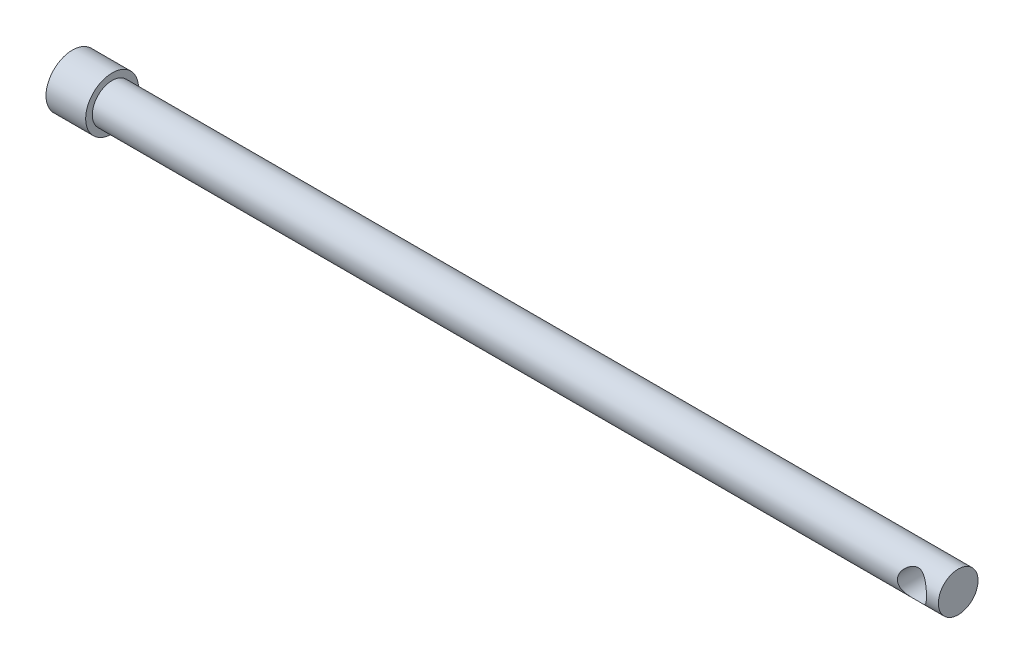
ISO-10303-21;
HEADER;
FILE_DESCRIPTION(('STEP AP214'),'2;1');
FILE_NAME('part.step','',(''),(''),'','','');
FILE_SCHEMA(('AUTOMOTIVE_DESIGN { 1 0 10303 214 1 1 1 1 }'));
ENDSEC;
DATA;
#1=APPLICATION_CONTEXT('core data for automotive mechanical design processes');
#2=APPLICATION_PROTOCOL_DEFINITION('international standard','automotive_design',2000,#1);
#3=PRODUCT_CONTEXT('',#1,'mechanical');
#4=PRODUCT('Part','Part','',(#3));
#5=PRODUCT_RELATED_PRODUCT_CATEGORY('part','',(#4));
#6=PRODUCT_DEFINITION_FORMATION('','',#4);
#7=PRODUCT_DEFINITION_CONTEXT('part definition',#1,'design');
#8=PRODUCT_DEFINITION('design','',#6,#7);
#9=PRODUCT_DEFINITION_SHAPE('','',#8);
#10=(LENGTH_UNIT() NAMED_UNIT(*) SI_UNIT(.MILLI.,.METRE.));
#11=(NAMED_UNIT(*) PLANE_ANGLE_UNIT() SI_UNIT($,.RADIAN.));
#12=(NAMED_UNIT(*) SI_UNIT($,.STERADIAN.) SOLID_ANGLE_UNIT());
#13=UNCERTAINTY_MEASURE_WITH_UNIT(LENGTH_MEASURE(1.E-05),#10,'distance_accuracy_value','');
#14=(GEOMETRIC_REPRESENTATION_CONTEXT(3) GLOBAL_UNCERTAINTY_ASSIGNED_CONTEXT((#13)) GLOBAL_UNIT_ASSIGNED_CONTEXT((#10,
#11,#12)) REPRESENTATION_CONTEXT('',''));
#15=CARTESIAN_POINT('',(0.,0.,0.));
#16=DIRECTION('',(0.,0.,1.));
#17=DIRECTION('',(1.,0.,0.));
#18=AXIS2_PLACEMENT_3D('',#15,#16,#17);
#19=CARTESIAN_POINT('',(-650.,0.,0.));
#20=DIRECTION('',(1.,0.,0.));
#21=DIRECTION('',(0.,0.,-1.));
#22=AXIS2_PLACEMENT_3D('',#19,#20,#21);
#23=PLANE('',#22);
#24=CARTESIAN_POINT('',(-650.,0.,0.));
#25=DIRECTION('',(-1.,0.,0.));
#26=DIRECTION('',(0.,0.,1.));
#27=AXIS2_PLACEMENT_3D('',#24,#25,#26);
#28=CIRCLE('',#27,20.);
#29=CARTESIAN_POINT('',(-650.,0.,20.));
#30=VERTEX_POINT('',#29);
#31=EDGE_CURVE('E18',#30,#30,#28,.F.);
#32=ORIENTED_EDGE('',*,*,#31,.F.);
#33=EDGE_LOOP('',(#32));
#34=FACE_BOUND('',#33,.T.);
#35=ADVANCED_FACE('F13',(#34),#23,.F.);
#36=CARTESIAN_POINT('',(-620.,0.,0.));
#37=DIRECTION('',(-1.,0.,0.));
#38=DIRECTION('',(0.,0.,1.));
#39=AXIS2_PLACEMENT_3D('',#36,#37,#38);
#40=CYLINDRICAL_SURFACE('',#39,20.);
#41=ORIENTED_EDGE('',*,*,#31,.T.);
#42=EDGE_LOOP('',(#41));
#43=FACE_BOUND('',#42,.T.);
#44=CARTESIAN_POINT('',(-620.,0.,0.));
#45=DIRECTION('',(-1.,0.,0.));
#46=DIRECTION('',(0.,0.,1.));
#47=AXIS2_PLACEMENT_3D('',#44,#45,#46);
#48=CIRCLE('',#47,20.);
#49=CARTESIAN_POINT('',(-620.,0.,20.));
#50=VERTEX_POINT('',#49);
#51=EDGE_CURVE('E46',#50,#50,#48,.T.);
#52=ORIENTED_EDGE('',*,*,#51,.T.);
#53=EDGE_LOOP('',(#52));
#54=FACE_BOUND('',#53,.T.);
#55=ADVANCED_FACE('F53',(#43,#54),#40,.T.);
#56=CARTESIAN_POINT('',(20.,0.,0.));
#57=DIRECTION('',(1.,0.,0.));
#58=DIRECTION('',(0.,0.,-1.));
#59=AXIS2_PLACEMENT_3D('',#56,#57,#58);
#60=PLANE('',#59);
#61=CARTESIAN_POINT('',(20.,0.,0.));
#62=DIRECTION('',(-1.,0.,0.));
#63=DIRECTION('',(0.,0.,1.));
#64=AXIS2_PLACEMENT_3D('',#61,#62,#63);
#65=CIRCLE('',#64,15.);
#66=CARTESIAN_POINT('',(20.,0.,15.));
#67=VERTEX_POINT('',#66);
#68=EDGE_CURVE('E44',#67,#67,#65,.T.);
#69=ORIENTED_EDGE('',*,*,#68,.F.);
#70=EDGE_LOOP('',(#69));
#71=FACE_BOUND('',#70,.T.);
#72=ADVANCED_FACE('F61',(#71),#60,.T.);
#73=CARTESIAN_POINT('',(-620.,0.,0.));
#74=DIRECTION('',(-1.,0.,0.));
#75=DIRECTION('',(0.,0.,1.));
#76=AXIS2_PLACEMENT_3D('',#73,#74,#75);
#77=PLANE('',#76);
#78=CARTESIAN_POINT('',(-620.,0.,0.));
#79=DIRECTION('',(-1.,0.,0.));
#80=DIRECTION('',(0.,0.,1.));
#81=AXIS2_PLACEMENT_3D('',#78,#79,#80);
#82=CIRCLE('',#81,15.);
#83=CARTESIAN_POINT('',(-620.,0.,15.));
#84=VERTEX_POINT('',#83);
#85=EDGE_CURVE('E22',#84,#84,#82,.F.);
#86=ORIENTED_EDGE('',*,*,#85,.F.);
#87=EDGE_LOOP('',(#86));
#88=FACE_BOUND('',#87,.T.);
#89=ORIENTED_EDGE('',*,*,#51,.F.);
#90=EDGE_LOOP('',(#89));
#91=FACE_BOUND('',#90,.T.);
#92=ADVANCED_FACE('F36',(#88,#91),#77,.F.);
#93=CARTESIAN_POINT('',(0.,0.,-15.));
#94=DIRECTION('',(0.,0.,1.));
#95=DIRECTION('',(1.,0.,0.));
#96=AXIS2_PLACEMENT_3D('',#93,#94,#95);
#97=CYLINDRICAL_SURFACE('',#96,11.);
#98=CARTESIAN_POINT('',(11.,0.,-15.));
#99=CARTESIAN_POINT('',(10.9999989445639,0.270234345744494,-14.9999989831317));
#100=CARTESIAN_POINT('',(10.9900265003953,0.540485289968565,-14.9926814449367));
#101=CARTESIAN_POINT('',(10.950295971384,1.07885095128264,-14.963582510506));
#102=CARTESIAN_POINT('',(10.9205289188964,1.34696464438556,-14.9417945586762));
#103=CARTESIAN_POINT('',(10.8416275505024,1.87926318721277,-14.8842251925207));
#104=CARTESIAN_POINT('',(10.792460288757,2.14344055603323,-14.8484199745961));
#105=CARTESIAN_POINT('',(10.6755308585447,2.66544248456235,-14.7636492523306));
#106=CARTESIAN_POINT('',(10.60777051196,2.92326766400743,-14.7146850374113));
#107=CARTESIAN_POINT('',(10.455056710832,3.42947281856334,-14.6049788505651));
#108=CARTESIAN_POINT('',(10.3702054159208,3.67789896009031,-14.5443069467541));
#109=CARTESIAN_POINT('',(10.1841148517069,4.16556445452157,-14.4122135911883));
#110=CARTESIAN_POINT('',(10.0828752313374,4.40480361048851,-14.3407919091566));
#111=CARTESIAN_POINT('',(9.86513916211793,4.87295052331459,-14.1885487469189));
#112=CARTESIAN_POINT('',(9.7486501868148,5.10186326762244,-14.1077318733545));
#113=CARTESIAN_POINT('',(9.50137535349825,5.5487947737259,-13.9380072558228));
#114=CARTESIAN_POINT('',(9.37058417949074,5.76680944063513,-13.8490965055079));
#115=CARTESIAN_POINT('',(9.08316785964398,6.21065135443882,-13.6561916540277));
#116=CARTESIAN_POINT('',(8.92527466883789,6.4353804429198,-13.5515613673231));
#117=CARTESIAN_POINT('',(8.59474679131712,6.8705899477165,-13.3361895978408));
#118=CARTESIAN_POINT('',(8.42211168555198,7.08106995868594,-13.2254479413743));
#119=CARTESIAN_POINT('',(8.06272673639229,7.48773584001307,-12.9995381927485));
#120=CARTESIAN_POINT('',(7.87595550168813,7.68389912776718,-12.8843635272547));
#121=CARTESIAN_POINT('',(7.48928883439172,8.06123556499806,-12.6517037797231));
#122=CARTESIAN_POINT('',(7.28939585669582,8.242411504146,-12.5342191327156));
#123=CARTESIAN_POINT('',(6.83682363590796,8.62331346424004,-12.2760403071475));
#124=CARTESIAN_POINT('',(6.58144005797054,8.81979231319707,-12.1352768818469));
#125=CARTESIAN_POINT('',(6.05311944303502,9.19042440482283,-11.8570571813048));
#126=CARTESIAN_POINT('',(5.7801773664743,9.36457119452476,-11.7196018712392));
#127=CARTESIAN_POINT('',(5.21744212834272,9.68936187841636,-11.4525286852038));
#128=CARTESIAN_POINT('',(4.92766801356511,9.84003165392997,-11.3229022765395));
#129=CARTESIAN_POINT('',(4.33141573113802,10.1166556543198,-11.076442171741));
#130=CARTESIAN_POINT('',(4.02494703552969,10.242623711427,-10.9596013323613));
#131=CARTESIAN_POINT('',(3.50094853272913,10.4303850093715,-10.7804394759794));
#132=CARTESIAN_POINT('',(3.28782250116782,10.4995737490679,-10.7129270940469));
#133=CARTESIAN_POINT('',(2.85500800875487,10.625426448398,-10.5881143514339));
#134=CARTESIAN_POINT('',(2.6353216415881,10.6820943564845,-10.5308107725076));
#135=CARTESIAN_POINT('',(2.19056026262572,10.7820819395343,-10.4284147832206));
#136=CARTESIAN_POINT('',(1.9654960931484,10.8254263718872,-10.3832997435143));
#137=CARTESIAN_POINT('',(1.51077883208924,10.8981901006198,-10.3069029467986));
#138=CARTESIAN_POINT('',(1.28112576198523,10.9276094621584,-10.2756211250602));
#139=CARTESIAN_POINT('',(0.817016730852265,10.9721120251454,-10.2280907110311));
#140=CARTESIAN_POINT('',(0.582537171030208,10.9870802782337,-10.2119626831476));
#141=CARTESIAN_POINT('',(0.112548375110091,11.0019364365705,-10.1959559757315));
#142=CARTESIAN_POINT('',(-0.122960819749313,11.0018249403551,-10.1960766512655));
#143=CARTESIAN_POINT('',(-0.593049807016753,10.9865203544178,-10.2125654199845));
#144=CARTESIAN_POINT('',(-0.827628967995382,10.9713183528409,-10.2289431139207));
#145=CARTESIAN_POINT('',(-1.29374843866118,10.9261645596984,-10.2771594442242));
#146=CARTESIAN_POINT('',(-1.52528840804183,10.8962111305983,-10.3089997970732));
#147=CARTESIAN_POINT('',(-2.00856310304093,10.8181280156,-10.3909399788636));
#148=CARTESIAN_POINT('',(-2.25976351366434,10.7683789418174,-10.4426460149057));
#149=CARTESIAN_POINT('',(-2.75472374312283,10.6525201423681,-10.5608080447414));
#150=CARTESIAN_POINT('',(-2.99848250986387,10.5864081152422,-10.6272661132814));
#151=CARTESIAN_POINT('',(-3.71799960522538,10.3647718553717,-10.8450088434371));
#152=CARTESIAN_POINT('',(-4.18133061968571,10.1860595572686,-11.0145361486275));
#153=CARTESIAN_POINT('',(-4.92554456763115,9.84116811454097,-11.3219366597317));
#154=CARTESIAN_POINT('',(-5.2168211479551,9.68975954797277,-11.4522158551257));
#155=CARTESIAN_POINT('',(-5.78225957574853,9.36333004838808,-11.7206082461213));
#156=CARTESIAN_POINT('',(-6.05641582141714,9.18830144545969,-11.8587239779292));
#157=CARTESIAN_POINT('',(-6.58728128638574,8.81550158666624,-12.1384232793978));
#158=CARTESIAN_POINT('',(-6.8439744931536,8.61770989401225,-12.2800098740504));
#159=CARTESIAN_POINT('',(-7.33908375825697,8.20016329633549,-12.562678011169));
#160=CARTESIAN_POINT('',(-7.57750193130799,7.9804109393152,-12.7037596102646));
#161=CARTESIAN_POINT('',(-8.03836541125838,7.51619216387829,-12.9838893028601));
#162=CARTESIAN_POINT('',(-8.26054003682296,7.27142254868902,-13.1228811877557));
#163=CARTESIAN_POINT('',(-8.68379183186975,6.76031353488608,-13.3933474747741));
#164=CARTESIAN_POINT('',(-8.88486659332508,6.4939716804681,-13.5248210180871));
#165=CARTESIAN_POINT('',(-9.26374282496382,5.9409781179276,-13.7766812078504));
#166=CARTESIAN_POINT('',(-9.44158119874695,5.65435975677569,-13.8970853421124));
#167=CARTESIAN_POINT('',(-9.7721047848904,5.06171559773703,-14.1237235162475));
#168=CARTESIAN_POINT('',(-9.92480016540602,4.75569771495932,-14.2299632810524));
#169=CARTESIAN_POINT('',(-10.1671126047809,4.20659794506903,-14.4001660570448));
#170=CARTESIAN_POINT('',(-10.2628788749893,3.96740850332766,-14.4679959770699));
#171=CARTESIAN_POINT('',(-10.4380921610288,3.48039642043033,-14.5928058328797));
#172=CARTESIAN_POINT('',(-10.5175428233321,3.2325757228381,-14.649788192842));
#173=CARTESIAN_POINT('',(-10.659004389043,2.73012906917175,-14.7516769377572));
#174=CARTESIAN_POINT('',(-10.7210502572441,2.47551789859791,-14.7966075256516));
#175=CARTESIAN_POINT('',(-10.8270300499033,1.96072320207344,-14.8735755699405));
#176=CARTESIAN_POINT('',(-10.87097136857,1.70054199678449,-14.9056182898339));
#177=CARTESIAN_POINT('',(-10.9368839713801,1.20084572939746,-14.953761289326));
#178=CARTESIAN_POINT('',(-10.9605217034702,0.961665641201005,-14.9710694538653));
#179=CARTESIAN_POINT('',(-10.9920819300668,0.481661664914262,-14.994190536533));
#180=CARTESIAN_POINT('',(-11.0000009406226,0.240837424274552,-15.0000009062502));
#181=CARTESIAN_POINT('',(-10.9999989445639,-0.270234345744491,-14.9999989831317));
#182=CARTESIAN_POINT('',(-10.9900265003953,-0.540485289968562,-14.9926814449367));
#183=CARTESIAN_POINT('',(-10.950295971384,-1.07885095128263,-14.963582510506));
#184=CARTESIAN_POINT('',(-10.9205289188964,-1.34696464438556,-14.9417945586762));
#185=CARTESIAN_POINT('',(-10.8416275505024,-1.87926318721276,-14.8842251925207));
#186=CARTESIAN_POINT('',(-10.792460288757,-2.14344055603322,-14.8484199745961));
#187=CARTESIAN_POINT('',(-10.6755308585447,-2.66544248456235,-14.7636492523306));
#188=CARTESIAN_POINT('',(-10.60777051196,-2.92326766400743,-14.7146850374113));
#189=CARTESIAN_POINT('',(-10.455056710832,-3.42947281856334,-14.6049788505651));
#190=CARTESIAN_POINT('',(-10.3702054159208,-3.67789896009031,-14.5443069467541));
#191=CARTESIAN_POINT('',(-10.1841148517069,-4.16556445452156,-14.4122135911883));
#192=CARTESIAN_POINT('',(-10.0828752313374,-4.40480361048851,-14.3407919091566));
#193=CARTESIAN_POINT('',(-9.86513916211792,-4.87295052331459,-14.1885487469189));
#194=CARTESIAN_POINT('',(-9.7486501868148,-5.10186326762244,-14.1077318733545));
#195=CARTESIAN_POINT('',(-9.50137535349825,-5.5487947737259,-13.9380072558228));
#196=CARTESIAN_POINT('',(-9.37058417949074,-5.76680944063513,-13.8490965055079));
#197=CARTESIAN_POINT('',(-9.08316785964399,-6.21065135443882,-13.6561916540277));
#198=CARTESIAN_POINT('',(-8.92527466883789,-6.4353804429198,-13.5515613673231));
#199=CARTESIAN_POINT('',(-8.59474679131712,-6.8705899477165,-13.3361895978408));
#200=CARTESIAN_POINT('',(-8.42211168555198,-7.08106995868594,-13.2254479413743));
#201=CARTESIAN_POINT('',(-8.06272673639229,-7.48773584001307,-12.9995381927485));
#202=CARTESIAN_POINT('',(-7.87595550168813,-7.68389912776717,-12.8843635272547));
#203=CARTESIAN_POINT('',(-7.48928883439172,-8.06123556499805,-12.6517037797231));
#204=CARTESIAN_POINT('',(-7.28939585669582,-8.242411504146,-12.5342191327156));
#205=CARTESIAN_POINT('',(-6.83682363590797,-8.62331346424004,-12.2760403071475));
#206=CARTESIAN_POINT('',(-6.58144005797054,-8.81979231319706,-12.1352768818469));
#207=CARTESIAN_POINT('',(-6.05311944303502,-9.19042440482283,-11.8570571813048));
#208=CARTESIAN_POINT('',(-5.78017736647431,-9.36457119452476,-11.7196018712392));
#209=CARTESIAN_POINT('',(-5.21744212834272,-9.68936187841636,-11.4525286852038));
#210=CARTESIAN_POINT('',(-4.92766801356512,-9.84003165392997,-11.3229022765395));
#211=CARTESIAN_POINT('',(-4.33141573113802,-10.1166556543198,-11.076442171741));
#212=CARTESIAN_POINT('',(-4.02494703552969,-10.242623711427,-10.9596013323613));
#213=CARTESIAN_POINT('',(-3.50094853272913,-10.4303850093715,-10.7804394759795));
#214=CARTESIAN_POINT('',(-3.28782250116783,-10.4995737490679,-10.7129270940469));
#215=CARTESIAN_POINT('',(-2.85500800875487,-10.625426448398,-10.5881143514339));
#216=CARTESIAN_POINT('',(-2.63532164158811,-10.6820943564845,-10.5308107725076));
#217=CARTESIAN_POINT('',(-2.19056026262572,-10.7820819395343,-10.4284147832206));
#218=CARTESIAN_POINT('',(-1.9654960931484,-10.8254263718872,-10.3832997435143));
#219=CARTESIAN_POINT('',(-1.51077883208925,-10.8981901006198,-10.3069029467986));
#220=CARTESIAN_POINT('',(-1.28112576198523,-10.9276094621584,-10.2756211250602));
#221=CARTESIAN_POINT('',(-0.817016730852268,-10.9721120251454,-10.2280907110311));
#222=CARTESIAN_POINT('',(-0.582537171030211,-10.9870802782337,-10.2119626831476));
#223=CARTESIAN_POINT('',(-0.112548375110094,-11.0019364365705,-10.1959559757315));
#224=CARTESIAN_POINT('',(0.12296081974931,-11.0018249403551,-10.1960766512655));
#225=CARTESIAN_POINT('',(0.593049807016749,-10.9865203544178,-10.2125654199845));
#226=CARTESIAN_POINT('',(0.827628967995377,-10.9713183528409,-10.2289431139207));
#227=CARTESIAN_POINT('',(1.29374843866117,-10.9261645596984,-10.2771594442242));
#228=CARTESIAN_POINT('',(1.52528840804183,-10.8962111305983,-10.3089997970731));
#229=CARTESIAN_POINT('',(2.00856310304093,-10.8181280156,-10.3909399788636));
#230=CARTESIAN_POINT('',(2.25976351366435,-10.7683789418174,-10.4426460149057));
#231=CARTESIAN_POINT('',(2.75472374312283,-10.652520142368,-10.5608080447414));
#232=CARTESIAN_POINT('',(2.99848250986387,-10.5864081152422,-10.6272661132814));
#233=CARTESIAN_POINT('',(3.71799960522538,-10.3647718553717,-10.8450088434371));
#234=CARTESIAN_POINT('',(4.1813306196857,-10.1860595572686,-11.0145361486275));
#235=CARTESIAN_POINT('',(4.92554456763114,-9.84116811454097,-11.3219366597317));
#236=CARTESIAN_POINT('',(5.21682114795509,-9.68975954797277,-11.4522158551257));
#237=CARTESIAN_POINT('',(5.78225957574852,-9.36333004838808,-11.7206082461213));
#238=CARTESIAN_POINT('',(6.05641582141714,-9.1883014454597,-11.8587239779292));
#239=CARTESIAN_POINT('',(6.58728128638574,-8.81550158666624,-12.1384232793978));
#240=CARTESIAN_POINT('',(6.84397449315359,-8.61770989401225,-12.2800098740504));
#241=CARTESIAN_POINT('',(7.33908375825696,-8.20016329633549,-12.562678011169));
#242=CARTESIAN_POINT('',(7.57750193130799,-7.9804109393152,-12.7037596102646));
#243=CARTESIAN_POINT('',(8.03836541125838,-7.51619216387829,-12.9838893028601));
#244=CARTESIAN_POINT('',(8.26054003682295,-7.27142254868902,-13.1228811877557));
#245=CARTESIAN_POINT('',(8.68379183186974,-6.76031353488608,-13.3933474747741));
#246=CARTESIAN_POINT('',(8.88486659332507,-6.49397168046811,-13.5248210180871));
#247=CARTESIAN_POINT('',(9.26374282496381,-5.94097811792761,-13.7766812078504));
#248=CARTESIAN_POINT('',(9.44158119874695,-5.6543597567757,-13.8970853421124));
#249=CARTESIAN_POINT('',(9.7721047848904,-5.06171559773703,-14.1237235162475));
#250=CARTESIAN_POINT('',(9.92480016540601,-4.75569771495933,-14.2299632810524));
#251=CARTESIAN_POINT('',(10.1671126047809,-4.20659794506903,-14.4001660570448));
#252=CARTESIAN_POINT('',(10.2628788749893,-3.96740850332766,-14.4679959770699));
#253=CARTESIAN_POINT('',(10.4380921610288,-3.48039642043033,-14.5928058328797));
#254=CARTESIAN_POINT('',(10.5175428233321,-3.2325757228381,-14.649788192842));
#255=CARTESIAN_POINT('',(10.659004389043,-2.73012906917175,-14.7516769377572));
#256=CARTESIAN_POINT('',(10.7210502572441,-2.47551789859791,-14.7966075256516));
#257=CARTESIAN_POINT('',(10.8270300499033,-1.96072320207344,-14.8735755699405));
#258=CARTESIAN_POINT('',(10.87097136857,-1.7005419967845,-14.9056182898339));
#259=CARTESIAN_POINT('',(10.9368839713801,-1.20084572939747,-14.953761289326));
#260=CARTESIAN_POINT('',(10.9605217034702,-0.961665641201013,-14.9710694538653));
#261=CARTESIAN_POINT('',(10.9920819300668,-0.481661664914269,-14.994190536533));
#262=CARTESIAN_POINT('',(11.0000009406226,-0.240837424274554,-15.0000009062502));
#263=CARTESIAN_POINT('',(11.,0.,-15.));
#264=B_SPLINE_CURVE_WITH_KNOTS('',3,(#98,#99,#100,#101,#102,#103,#104,#105,#106,#107,#108,#109,
#110,#111,#112,#113,#114,#115,#116,#117,#118,#119,#120,#121,#122,#123,#124,#125,#126,#127,#128,
#129,#130,#131,#132,#133,#134,#135,#136,#137,#138,#139,#140,#141,#142,#143,#144,#145,#146,#147,
#148,#149,#150,#151,#152,#153,#154,#155,#156,#157,#158,#159,#160,#161,#162,#163,#164,#165,#166,
#167,#168,#169,#170,#171,#172,#173,#174,#175,#176,#177,#178,#179,#180,#181,#182,#183,#184,#185,
#186,#187,#188,#189,#190,#191,#192,#193,#194,#195,#196,#197,#198,#199,#200,#201,#202,#203,#204,
#205,#206,#207,#208,#209,#210,#211,#212,#213,#214,#215,#216,#217,#218,#219,#220,#221,#222,#223,
#224,#225,#226,#227,#228,#229,#230,#231,#232,#233,#234,#235,#236,#237,#238,#239,#240,#241,#242,
#243,#244,#245,#246,#247,#248,#249,#250,#251,#252,#253,#254,#255,#256,#257,#258,#259,#260,#261,
#262,#263),.UNSPECIFIED.,.T.,.F.,(4,2,2,2,2,2,2,2,2,2,2,2,2,2,2,2,2,2,2,2,2,2,2,2,2,2,2,2,2,2,2,
2,2,2,2,2,2,2,2,2,2,2,2,2,2,2,2,2,2,2,2,2,2,2,2,2,2,2,2,2,2,2,2,2,2,2,2,2,2,2,2,2,2,2,2,2,2,2,2,
2,2,2,4),(0.,0.810451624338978,1.62127066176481,2.43347261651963,3.245595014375,
4.05299986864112,4.86042202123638,5.66744993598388,6.4747788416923,7.35566894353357,
8.23658409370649,9.11886000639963,10.0009713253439,11.0546742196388,12.1086809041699,
13.1615172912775,14.2137624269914,14.9152774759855,15.6165709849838,16.3165533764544,
17.0165324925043,17.7220346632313,18.4275088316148,19.1333998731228,19.8393692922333,
20.6219293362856,21.4045995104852,22.9719812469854,24.0304577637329,25.0892788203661,
26.1490580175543,27.2087143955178,28.2832214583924,29.3578510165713,30.4307525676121,
31.5032191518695,32.301720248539,33.100042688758,33.8967496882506,34.6931309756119,
35.4152591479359,36.1375473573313,36.9479989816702,37.7588180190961,38.5710199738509,
39.3831423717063,40.1905472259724,40.9979693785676,41.8049972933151,42.6123261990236,
43.4932163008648,44.3741314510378,45.2564073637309,46.1385186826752,47.1922215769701,
48.2462282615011,49.2990646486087,50.3513097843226,51.0528248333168,51.7541183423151,
52.4541007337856,53.1540798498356,53.8595820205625,54.5650561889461,55.2709472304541,
55.9769166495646,56.7594766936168,57.5421468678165,59.1095286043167,60.1680051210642,
61.2268261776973,62.2866053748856,63.3462617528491,64.4207688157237,65.4953983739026,
66.5682999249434,67.6407665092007,68.4392676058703,69.2375900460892,70.0342970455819,
70.8306783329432,71.5528065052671,72.2750947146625),.UNSPECIFIED.);
#265=CARTESIAN_POINT('',(11.,0.,-15.));
#266=VERTEX_POINT('',#265);
#267=EDGE_CURVE('E27',#266,#266,#264,.T.);
#268=ORIENTED_EDGE('',*,*,#267,.F.);
#269=EDGE_LOOP('',(#268));
#270=FACE_BOUND('',#269,.T.);
#271=CARTESIAN_POINT('',(-11.,0.,15.));
#272=CARTESIAN_POINT('',(-10.9999989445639,0.270234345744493,14.9999989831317));
#273=CARTESIAN_POINT('',(-10.9900265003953,0.540485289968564,14.9926814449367));
#274=CARTESIAN_POINT('',(-10.950295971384,1.07885095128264,14.963582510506));
#275=CARTESIAN_POINT('',(-10.9205289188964,1.34696464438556,14.9417945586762));
#276=CARTESIAN_POINT('',(-10.8416275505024,1.87926318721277,14.8842251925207));
#277=CARTESIAN_POINT('',(-10.792460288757,2.14344055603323,14.8484199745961));
#278=CARTESIAN_POINT('',(-10.6755308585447,2.66544248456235,14.7636492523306));
#279=CARTESIAN_POINT('',(-10.60777051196,2.92326766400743,14.7146850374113));
#280=CARTESIAN_POINT('',(-10.455056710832,3.42947281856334,14.6049788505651));
#281=CARTESIAN_POINT('',(-10.3702054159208,3.67789896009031,14.5443069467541));
#282=CARTESIAN_POINT('',(-10.1841148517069,4.16556445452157,14.4122135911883));
#283=CARTESIAN_POINT('',(-10.0828752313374,4.40480361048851,14.3407919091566));
#284=CARTESIAN_POINT('',(-9.86513916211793,4.87295052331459,14.1885487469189));
#285=CARTESIAN_POINT('',(-9.7486501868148,5.10186326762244,14.1077318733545));
#286=CARTESIAN_POINT('',(-9.50137535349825,5.5487947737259,13.9380072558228));
#287=CARTESIAN_POINT('',(-9.37058417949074,5.76680944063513,13.8490965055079));
#288=CARTESIAN_POINT('',(-9.08316785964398,6.21065135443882,13.6561916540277));
#289=CARTESIAN_POINT('',(-8.92527466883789,6.4353804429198,13.5515613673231));
#290=CARTESIAN_POINT('',(-8.59474679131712,6.8705899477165,13.3361895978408));
#291=CARTESIAN_POINT('',(-8.42211168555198,7.08106995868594,13.2254479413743));
#292=CARTESIAN_POINT('',(-8.06272673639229,7.48773584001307,12.9995381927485));
#293=CARTESIAN_POINT('',(-7.87595550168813,7.68389912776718,12.8843635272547));
#294=CARTESIAN_POINT('',(-7.48928883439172,8.06123556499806,12.6517037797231));
#295=CARTESIAN_POINT('',(-7.28939585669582,8.242411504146,12.5342191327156));
#296=CARTESIAN_POINT('',(-6.83682363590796,8.62331346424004,12.2760403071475));
#297=CARTESIAN_POINT('',(-6.58144005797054,8.81979231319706,12.1352768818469));
#298=CARTESIAN_POINT('',(-6.05311944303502,9.19042440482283,11.8570571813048));
#299=CARTESIAN_POINT('',(-5.7801773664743,9.36457119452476,11.7196018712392));
#300=CARTESIAN_POINT('',(-5.21744212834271,9.68936187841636,11.4525286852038));
#301=CARTESIAN_POINT('',(-4.92766801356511,9.84003165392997,11.3229022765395));
#302=CARTESIAN_POINT('',(-4.33141573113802,10.1166556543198,11.076442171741));
#303=CARTESIAN_POINT('',(-4.02494703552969,10.242623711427,10.9596013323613));
#304=CARTESIAN_POINT('',(-3.50094853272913,10.4303850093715,10.7804394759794));
#305=CARTESIAN_POINT('',(-3.28782250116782,10.4995737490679,10.7129270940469));
#306=CARTESIAN_POINT('',(-2.85500800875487,10.625426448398,10.5881143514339));
#307=CARTESIAN_POINT('',(-2.6353216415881,10.6820943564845,10.5308107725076));
#308=CARTESIAN_POINT('',(-2.19056026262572,10.7820819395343,10.4284147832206));
#309=CARTESIAN_POINT('',(-1.9654960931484,10.8254263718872,10.3832997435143));
#310=CARTESIAN_POINT('',(-1.51077883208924,10.8981901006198,10.3069029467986));
#311=CARTESIAN_POINT('',(-1.28112576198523,10.9276094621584,10.2756211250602));
#312=CARTESIAN_POINT('',(-0.817016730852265,10.9721120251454,10.2280907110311));
#313=CARTESIAN_POINT('',(-0.582537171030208,10.9870802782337,10.2119626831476));
#314=CARTESIAN_POINT('',(-0.112548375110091,11.0019364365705,10.1959559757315));
#315=CARTESIAN_POINT('',(0.122960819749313,11.0018249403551,10.1960766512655));
#316=CARTESIAN_POINT('',(0.593049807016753,10.9865203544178,10.2125654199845));
#317=CARTESIAN_POINT('',(0.827628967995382,10.9713183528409,10.2289431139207));
#318=CARTESIAN_POINT('',(1.29374843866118,10.9261645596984,10.2771594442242));
#319=CARTESIAN_POINT('',(1.52528840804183,10.8962111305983,10.3089997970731));
#320=CARTESIAN_POINT('',(2.00856310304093,10.8181280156,10.3909399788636));
#321=CARTESIAN_POINT('',(2.25976351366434,10.7683789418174,10.4426460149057));
#322=CARTESIAN_POINT('',(2.75472374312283,10.652520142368,10.5608080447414));
#323=CARTESIAN_POINT('',(2.99848250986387,10.5864081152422,10.6272661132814));
#324=CARTESIAN_POINT('',(3.71799960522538,10.3647718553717,10.8450088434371));
#325=CARTESIAN_POINT('',(4.18133061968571,10.1860595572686,11.0145361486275));
#326=CARTESIAN_POINT('',(4.92554456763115,9.84116811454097,11.3219366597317));
#327=CARTESIAN_POINT('',(5.2168211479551,9.68975954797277,11.4522158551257));
#328=CARTESIAN_POINT('',(5.78225957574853,9.36333004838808,11.7206082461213));
#329=CARTESIAN_POINT('',(6.05641582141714,9.18830144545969,11.8587239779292));
#330=CARTESIAN_POINT('',(6.58728128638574,8.81550158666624,12.1384232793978));
#331=CARTESIAN_POINT('',(6.8439744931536,8.61770989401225,12.2800098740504));
#332=CARTESIAN_POINT('',(7.33908375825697,8.20016329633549,12.562678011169));
#333=CARTESIAN_POINT('',(7.57750193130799,7.9804109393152,12.7037596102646));
#334=CARTESIAN_POINT('',(8.03836541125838,7.51619216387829,12.9838893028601));
#335=CARTESIAN_POINT('',(8.26054003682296,7.27142254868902,13.1228811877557));
#336=CARTESIAN_POINT('',(8.68379183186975,6.76031353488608,13.3933474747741));
#337=CARTESIAN_POINT('',(8.88486659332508,6.4939716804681,13.5248210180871));
#338=CARTESIAN_POINT('',(9.26374282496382,5.9409781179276,13.7766812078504));
#339=CARTESIAN_POINT('',(9.44158119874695,5.65435975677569,13.8970853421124));
#340=CARTESIAN_POINT('',(9.7721047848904,5.06171559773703,14.1237235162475));
#341=CARTESIAN_POINT('',(9.92480016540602,4.75569771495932,14.2299632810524));
#342=CARTESIAN_POINT('',(10.1671126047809,4.20659794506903,14.4001660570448));
#343=CARTESIAN_POINT('',(10.2628788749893,3.96740850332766,14.4679959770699));
#344=CARTESIAN_POINT('',(10.4380921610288,3.48039642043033,14.5928058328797));
#345=CARTESIAN_POINT('',(10.5175428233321,3.2325757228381,14.649788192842));
#346=CARTESIAN_POINT('',(10.659004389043,2.73012906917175,14.7516769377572));
#347=CARTESIAN_POINT('',(10.7210502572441,2.47551789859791,14.7966075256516));
#348=CARTESIAN_POINT('',(10.8270300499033,1.96072320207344,14.8735755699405));
#349=CARTESIAN_POINT('',(10.87097136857,1.70054199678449,14.9056182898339));
#350=CARTESIAN_POINT('',(10.9368839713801,1.20084572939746,14.953761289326));
#351=CARTESIAN_POINT('',(10.9605217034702,0.961665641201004,14.9710694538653));
#352=CARTESIAN_POINT('',(10.9920819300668,0.48166166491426,14.994190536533));
#353=CARTESIAN_POINT('',(11.0000009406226,0.24083742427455,15.0000009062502));
#354=CARTESIAN_POINT('',(10.9999989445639,-0.270234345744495,14.9999989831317));
#355=CARTESIAN_POINT('',(10.9900265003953,-0.540485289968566,14.9926814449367));
#356=CARTESIAN_POINT('',(10.950295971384,-1.07885095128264,14.963582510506));
#357=CARTESIAN_POINT('',(10.9205289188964,-1.34696464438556,14.9417945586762));
#358=CARTESIAN_POINT('',(10.8416275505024,-1.87926318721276,14.8842251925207));
#359=CARTESIAN_POINT('',(10.792460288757,-2.14344055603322,14.8484199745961));
#360=CARTESIAN_POINT('',(10.6755308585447,-2.66544248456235,14.7636492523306));
#361=CARTESIAN_POINT('',(10.60777051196,-2.92326766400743,14.7146850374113));
#362=CARTESIAN_POINT('',(10.455056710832,-3.42947281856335,14.6049788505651));
#363=CARTESIAN_POINT('',(10.3702054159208,-3.67789896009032,14.5443069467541));
#364=CARTESIAN_POINT('',(10.1841148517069,-4.16556445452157,14.4122135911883));
#365=CARTESIAN_POINT('',(10.0828752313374,-4.40480361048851,14.3407919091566));
#366=CARTESIAN_POINT('',(9.86513916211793,-4.87295052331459,14.1885487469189));
#367=CARTESIAN_POINT('',(9.7486501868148,-5.10186326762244,14.1077318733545));
#368=CARTESIAN_POINT('',(9.50137535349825,-5.54879477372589,13.9380072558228));
#369=CARTESIAN_POINT('',(9.37058417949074,-5.76680944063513,13.8490965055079));
#370=CARTESIAN_POINT('',(9.08316785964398,-6.21065135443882,13.6561916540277));
#371=CARTESIAN_POINT('',(8.92527466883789,-6.4353804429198,13.5515613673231));
#372=CARTESIAN_POINT('',(8.59474679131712,-6.8705899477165,13.3361895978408));
#373=CARTESIAN_POINT('',(8.42211168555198,-7.08106995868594,13.2254479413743));
#374=CARTESIAN_POINT('',(8.06272673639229,-7.48773584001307,12.9995381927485));
#375=CARTESIAN_POINT('',(7.87595550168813,-7.68389912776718,12.8843635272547));
#376=CARTESIAN_POINT('',(7.48928883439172,-8.06123556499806,12.6517037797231));
#377=CARTESIAN_POINT('',(7.28939585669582,-8.242411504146,12.5342191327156));
#378=CARTESIAN_POINT('',(6.83682363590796,-8.62331346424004,12.2760403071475));
#379=CARTESIAN_POINT('',(6.58144005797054,-8.81979231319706,12.1352768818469));
#380=CARTESIAN_POINT('',(6.05311944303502,-9.19042440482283,11.8570571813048));
#381=CARTESIAN_POINT('',(5.78017736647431,-9.36457119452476,11.7196018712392));
#382=CARTESIAN_POINT('',(5.21744212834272,-9.68936187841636,11.4525286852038));
#383=CARTESIAN_POINT('',(4.92766801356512,-9.84003165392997,11.3229022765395));
#384=CARTESIAN_POINT('',(4.33141573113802,-10.1166556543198,11.076442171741));
#385=CARTESIAN_POINT('',(4.02494703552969,-10.242623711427,10.9596013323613));
#386=CARTESIAN_POINT('',(3.50094853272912,-10.4303850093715,10.7804394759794));
#387=CARTESIAN_POINT('',(3.28782250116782,-10.4995737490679,10.7129270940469));
#388=CARTESIAN_POINT('',(2.85500800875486,-10.625426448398,10.5881143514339));
#389=CARTESIAN_POINT('',(2.6353216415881,-10.6820943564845,10.5308107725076));
#390=CARTESIAN_POINT('',(2.19056026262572,-10.7820819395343,10.4284147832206));
#391=CARTESIAN_POINT('',(1.9654960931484,-10.8254263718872,10.3832997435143));
#392=CARTESIAN_POINT('',(1.51077883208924,-10.8981901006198,10.3069029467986));
#393=CARTESIAN_POINT('',(1.28112576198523,-10.9276094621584,10.2756211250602));
#394=CARTESIAN_POINT('',(0.817016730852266,-10.9721120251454,10.2280907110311));
#395=CARTESIAN_POINT('',(0.58253717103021,-10.9870802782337,10.2119626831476));
#396=CARTESIAN_POINT('',(0.112548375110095,-11.0019364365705,10.1959559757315));
#397=CARTESIAN_POINT('',(-0.122960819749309,-11.0018249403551,10.1960766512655));
#398=CARTESIAN_POINT('',(-0.59304980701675,-10.9865203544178,10.2125654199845));
#399=CARTESIAN_POINT('',(-0.82762896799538,-10.9713183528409,10.2289431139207));
#400=CARTESIAN_POINT('',(-1.29374843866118,-10.9261645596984,10.2771594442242));
#401=CARTESIAN_POINT('',(-1.52528840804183,-10.8962111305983,10.3089997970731));
#402=CARTESIAN_POINT('',(-2.00856310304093,-10.8181280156,10.3909399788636));
#403=CARTESIAN_POINT('',(-2.25976351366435,-10.7683789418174,10.4426460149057));
#404=CARTESIAN_POINT('',(-2.75472374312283,-10.652520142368,10.5608080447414));
#405=CARTESIAN_POINT('',(-2.99848250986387,-10.5864081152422,10.6272661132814));
#406=CARTESIAN_POINT('',(-3.71799960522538,-10.3647718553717,10.8450088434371));
#407=CARTESIAN_POINT('',(-4.1813306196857,-10.1860595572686,11.0145361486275));
#408=CARTESIAN_POINT('',(-4.92554456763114,-9.84116811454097,11.3219366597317));
#409=CARTESIAN_POINT('',(-5.2168211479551,-9.68975954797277,11.4522158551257));
#410=CARTESIAN_POINT('',(-5.78225957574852,-9.36333004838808,11.7206082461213));
#411=CARTESIAN_POINT('',(-6.05641582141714,-9.1883014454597,11.8587239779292));
#412=CARTESIAN_POINT('',(-6.58728128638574,-8.81550158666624,12.1384232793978));
#413=CARTESIAN_POINT('',(-6.8439744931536,-8.61770989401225,12.2800098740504));
#414=CARTESIAN_POINT('',(-7.33908375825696,-8.20016329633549,12.562678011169));
#415=CARTESIAN_POINT('',(-7.57750193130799,-7.9804109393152,12.7037596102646));
#416=CARTESIAN_POINT('',(-8.03836541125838,-7.51619216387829,12.9838893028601));
#417=CARTESIAN_POINT('',(-8.26054003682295,-7.27142254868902,13.1228811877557));
#418=CARTESIAN_POINT('',(-8.68379183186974,-6.76031353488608,13.3933474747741));
#419=CARTESIAN_POINT('',(-8.88486659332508,-6.4939716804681,13.524821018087));
#420=CARTESIAN_POINT('',(-9.26374282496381,-5.9409781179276,13.7766812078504));
#421=CARTESIAN_POINT('',(-9.44158119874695,-5.6543597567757,13.8970853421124));
#422=CARTESIAN_POINT('',(-9.7721047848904,-5.06171559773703,14.1237235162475));
#423=CARTESIAN_POINT('',(-9.92480016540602,-4.75569771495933,14.2299632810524));
#424=CARTESIAN_POINT('',(-10.1671126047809,-4.20659794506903,14.4001660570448));
#425=CARTESIAN_POINT('',(-10.2628788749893,-3.96740850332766,14.4679959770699));
#426=CARTESIAN_POINT('',(-10.4380921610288,-3.48039642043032,14.5928058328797));
#427=CARTESIAN_POINT('',(-10.5175428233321,-3.2325757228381,14.649788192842));
#428=CARTESIAN_POINT('',(-10.659004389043,-2.73012906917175,14.7516769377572));
#429=CARTESIAN_POINT('',(-10.7210502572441,-2.47551789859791,14.7966075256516));
#430=CARTESIAN_POINT('',(-10.8270300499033,-1.96072320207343,14.8735755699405));
#431=CARTESIAN_POINT('',(-10.87097136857,-1.70054199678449,14.9056182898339));
#432=CARTESIAN_POINT('',(-10.9368839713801,-1.20084572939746,14.953761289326));
#433=CARTESIAN_POINT('',(-10.9605217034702,-0.961665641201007,14.9710694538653));
#434=CARTESIAN_POINT('',(-10.9920819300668,-0.481661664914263,14.994190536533));
#435=CARTESIAN_POINT('',(-11.0000009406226,-0.240837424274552,15.0000009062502));
#436=CARTESIAN_POINT('',(-11.,0.,15.));
#437=B_SPLINE_CURVE_WITH_KNOTS('',3,(#271,#272,#273,#274,#275,#276,#277,#278,#279,#280,#281,
#282,#283,#284,#285,#286,#287,#288,#289,#290,#291,#292,#293,#294,#295,#296,#297,#298,#299,#300,
#301,#302,#303,#304,#305,#306,#307,#308,#309,#310,#311,#312,#313,#314,#315,#316,#317,#318,#319,
#320,#321,#322,#323,#324,#325,#326,#327,#328,#329,#330,#331,#332,#333,#334,#335,#336,#337,#338,
#339,#340,#341,#342,#343,#344,#345,#346,#347,#348,#349,#350,#351,#352,#353,#354,#355,#356,#357,
#358,#359,#360,#361,#362,#363,#364,#365,#366,#367,#368,#369,#370,#371,#372,#373,#374,#375,#376,
#377,#378,#379,#380,#381,#382,#383,#384,#385,#386,#387,#388,#389,#390,#391,#392,#393,#394,#395,
#396,#397,#398,#399,#400,#401,#402,#403,#404,#405,#406,#407,#408,#409,#410,#411,#412,#413,#414,
#415,#416,#417,#418,#419,#420,#421,#422,#423,#424,#425,#426,#427,#428,#429,#430,#431,#432,#433,
#434,#435,#436),.UNSPECIFIED.,.T.,.F.,(4,2,2,2,2,2,2,2,2,2,2,2,2,2,2,2,2,2,2,2,2,2,2,2,2,2,2,2,
2,2,2,2,2,2,2,2,2,2,2,2,2,2,2,2,2,2,2,2,2,2,2,2,2,2,2,2,2,2,2,2,2,2,2,2,2,2,2,2,2,2,2,2,2,2,2,2,
2,2,2,2,2,2,4),(0.,0.810451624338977,1.62127066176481,2.43347261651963,3.245595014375,
4.05299986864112,4.86042202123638,5.66744993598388,6.4747788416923,7.35566894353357,
8.23658409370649,9.11886000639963,10.0009713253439,11.0546742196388,12.1086809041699,
13.1615172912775,14.2137624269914,14.9152774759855,15.6165709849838,16.3165533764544,
17.0165324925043,17.7220346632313,18.4275088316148,19.1333998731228,19.8393692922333,
20.6219293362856,21.4045995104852,22.9719812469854,24.0304577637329,25.0892788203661,
26.1490580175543,27.2087143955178,28.2832214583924,29.3578510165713,30.4307525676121,
31.5032191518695,32.301720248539,33.100042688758,33.8967496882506,34.6931309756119,
35.4152591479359,36.1375473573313,36.9479989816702,37.7588180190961,38.5710199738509,
39.3831423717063,40.1905472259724,40.9979693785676,41.8049972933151,42.6123261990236,
43.4932163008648,44.3741314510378,45.2564073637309,46.1385186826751,47.1922215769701,
48.2462282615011,49.2990646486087,50.3513097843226,51.0528248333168,51.7541183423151,
52.4541007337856,53.1540798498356,53.8595820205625,54.5650561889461,55.2709472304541,
55.9769166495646,56.7594766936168,57.5421468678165,59.1095286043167,60.1680051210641,
61.2268261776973,62.2866053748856,63.346261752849,64.4207688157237,65.4953983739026,
66.5682999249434,67.6407665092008,68.4392676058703,69.2375900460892,70.0342970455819,
70.8306783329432,71.5528065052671,72.2750947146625),.UNSPECIFIED.);
#438=CARTESIAN_POINT('',(-11.,0.,15.));
#439=VERTEX_POINT('',#438);
#440=EDGE_CURVE('E9',#439,#439,#437,.T.);
#441=ORIENTED_EDGE('',*,*,#440,.F.);
#442=EDGE_LOOP('',(#441));
#443=FACE_BOUND('',#442,.T.);
#444=ADVANCED_FACE('F32',(#270,#443),#97,.F.);
#445=CARTESIAN_POINT('',(20.,0.,0.));
#446=DIRECTION('',(-1.,0.,0.));
#447=DIRECTION('',(0.,0.,1.));
#448=AXIS2_PLACEMENT_3D('',#445,#446,#447);
#449=CYLINDRICAL_SURFACE('',#448,15.);
#450=ORIENTED_EDGE('',*,*,#267,.T.);
#451=EDGE_LOOP('',(#450));
#452=FACE_BOUND('',#451,.T.);
#453=ORIENTED_EDGE('',*,*,#85,.T.);
#454=EDGE_LOOP('',(#453));
#455=FACE_BOUND('',#454,.T.);
#456=ORIENTED_EDGE('',*,*,#440,.T.);
#457=EDGE_LOOP('',(#456));
#458=FACE_BOUND('',#457,.T.);
#459=ORIENTED_EDGE('',*,*,#68,.T.);
#460=EDGE_LOOP('',(#459));
#461=FACE_BOUND('',#460,.T.);
#462=ADVANCED_FACE('F15',(#452,#455,#458,#461),#449,.T.);
#463=CLOSED_SHELL('',(#35,#55,#72,#92,#444,#462));
#464=MANIFOLD_SOLID_BREP('B1',#463);
#465=ADVANCED_BREP_SHAPE_REPRESENTATION('',(#18,#464),#14);
#466=SHAPE_DEFINITION_REPRESENTATION(#9,#465);
ENDSEC;
END-ISO-10303-21;
